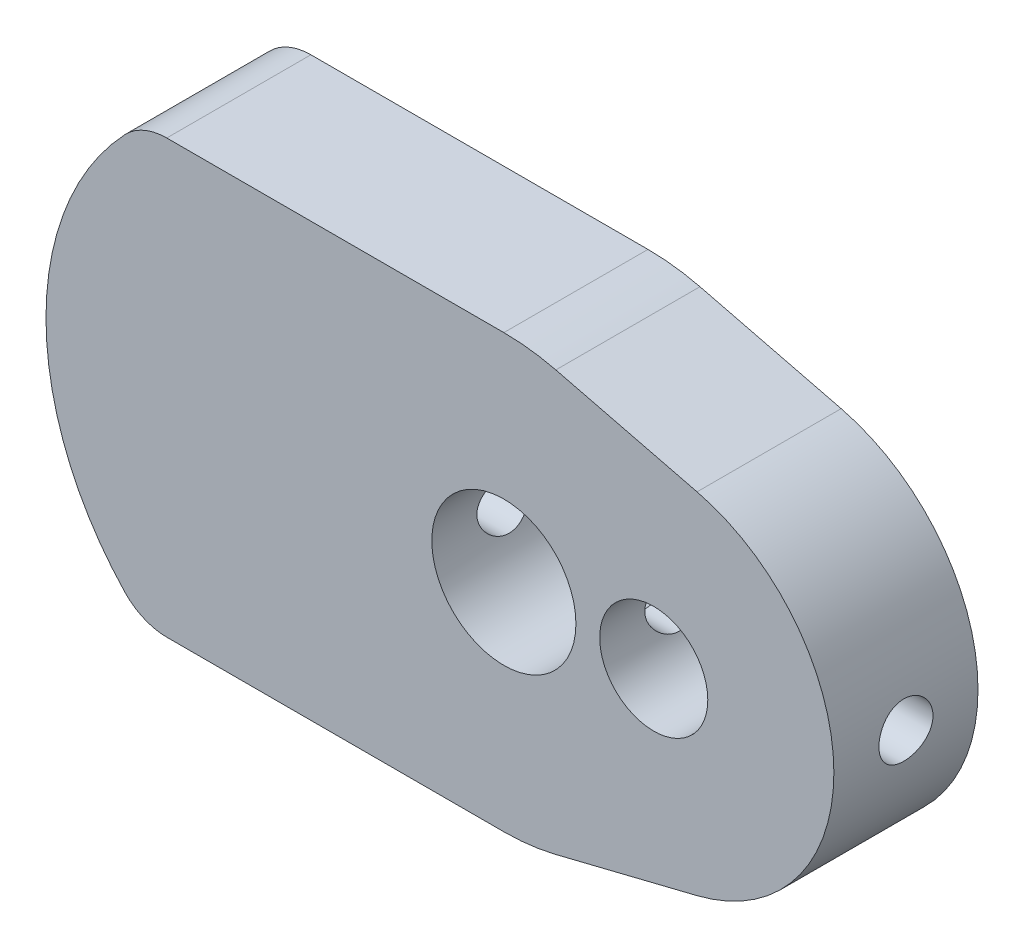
from build123d import *

# Parameters (mm, degrees)
SKETCH1_R               = 3.175
SKETCH1_R_2             = 2.38125
EXTRUDE1_DEPTH          = 3.175
EXTRUDE2_DEPTH          = 6.35
CUT_EXTRUDE2_DEPTH      = 23.53500316
CUT_EXTRUDE2_DEPTH_BACK = 23.53500316
SKETCH4_R               = 1.190625


with BuildPart() as part:
    # Sketch1 → Extrude1 (new, symmetric)
    with BuildSketch(Plane.XY):
        with BuildLine():
            Line((2.289663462, 9.245705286), (8.512052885, 7.704754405))
            ThreePointArc((8.512052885, 7.704754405), (14.5415, 0), (8.512052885, -7.704754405))
            Line((8.512052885, -7.704754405), (2.289663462, -9.245705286))
            ThreePointArc((2.289663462, -9.245705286), (-9.525, 0), (2.289663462, 9.245705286))
        make_face()
        Circle(SKETCH1_R, mode=Mode.SUBTRACT)
        with Locations((6.604, 0)):
            Circle(SKETCH1_R_2, mode=Mode.SUBTRACT)
    extrude(amount=EXTRUDE1_DEPTH, both=True)

    # Sketch3 → Extrude2 (add)
    with BuildSketch(Plane.XY.offset(3.175)):
        with BuildLine():
            Line((0, 9.525), (-14.852772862, 9.525))
            ThreePointArc((-14.852772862, 9.525), (-15.856796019, 9.31813898), (-16.697281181, 8.73125))
            ThreePointArc((-16.697281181, 8.73125), (-20.174739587, 0), (-16.697281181, -8.73125))
            ThreePointArc((-16.697281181, -8.73125), (-15.856796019, -9.31813898), (-14.852772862, -9.525))
            Line((-14.852772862, -9.525), (0, -9.525))
            ThreePointArc((0, -9.525), (-9.525, 0), (0, 9.525))
        make_face()
    extrude(amount=-EXTRUDE2_DEPTH)

    # Sketch4 → Cut-Extrude2 (cut, two sides: drawn at the far end of the back side and taken through both)
    with BuildSketch(Plane(origin=(0, 0, 0), x_dir=(0, 0, -1), z_dir=(1, 0, 0)).offset(-CUT_EXTRUDE2_DEPTH_BACK)):
        Circle(SKETCH4_R)
    extrude(amount=CUT_EXTRUDE2_DEPTH + CUT_EXTRUDE2_DEPTH_BACK, mode=Mode.SUBTRACT)


solid = part.part
